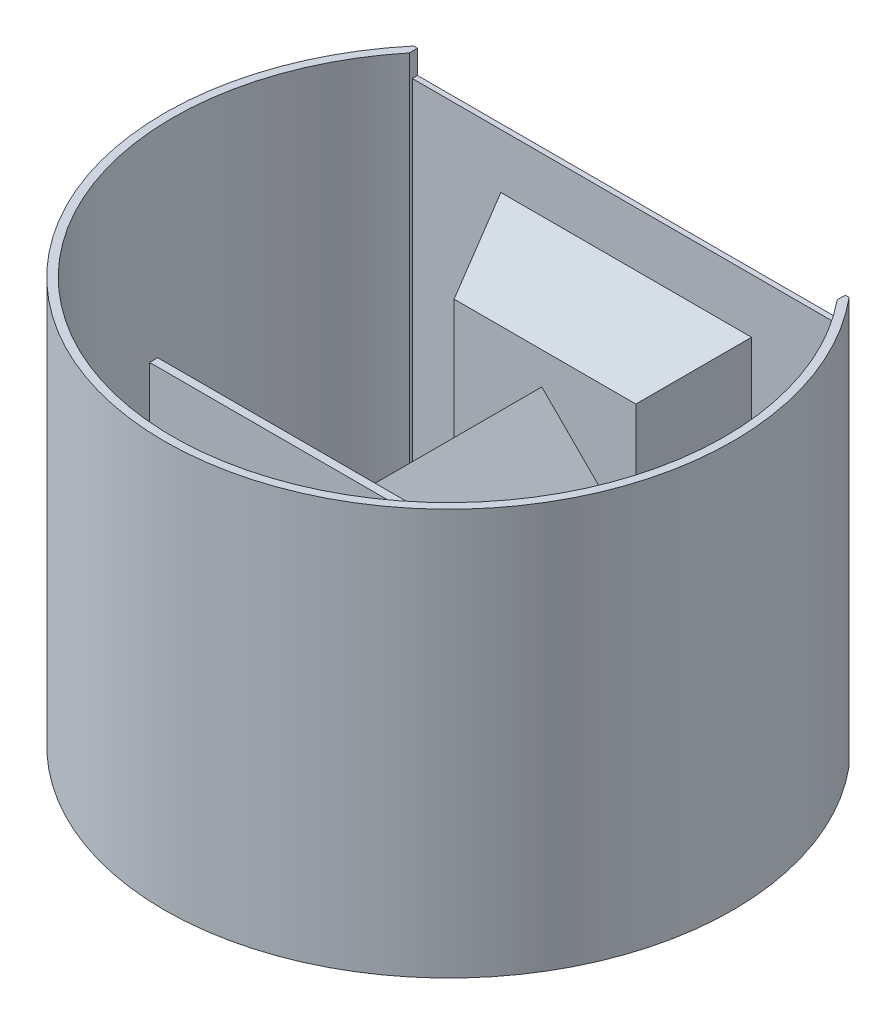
from build123d import *

# Parameters (mm, degrees)
SALIENTE_EXTRUIR1_DEPTH = 100
CROQUIS2_W              = 1.282639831
CROQUIS2_H              = 88.372891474
SALIENTE_EXTRUIR2_DEPTH = 106
CROQUIS3_W              = 61.743986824
CROQUIS3_H              = 61.53261187
SALIENTE_EXTRUIR3_DEPTH = 20
SALIENTE_EXTRUIR3_TAPER = 23
SALIENTE_EXTRUIR4_DEPTH = 61
CROQUIS5_W              = 68.764994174
CROQUIS5_H              = 68.55361922
SALIENTE_EXTRUIR5_DEPTH = 2


with BuildPart() as part:
    # Croquis1 → Saliente-Extruir1 (new body)
    with BuildSketch(Plane(origin=(0, 0, 0), x_dir=(1, 0, 0), z_dir=(0, 1, 0))):
        with BuildLine():
            Line((-53.619026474, 45), (-52.678268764, 45))
            Line((-52.678268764, 45), (-52.678268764, 43))
            ThreePointArc((-52.678268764, 43), (0, -68), (52.678268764, 43))
            Line((52.678268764, 43), (52.678268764, 45))
            Line((52.678268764, 45), (53.619026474, 45))
            ThreePointArc((53.619026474, 45), (0, -70), (-53.619026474, 45))
        make_face()
    extrude(amount=SALIENTE_EXTRUIR1_DEPTH)

    # Croquis2 → Saliente-Extruir2 (add)
    with BuildSketch(Plane(origin=(-52.678268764, 0, 0), x_dir=(0, 0, -1), z_dir=(1, 0, 0))):
        with Locations((44.358680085, 50)):
            Rectangle(CROQUIS2_W, CROQUIS2_H)
    extrude(amount=SALIENTE_EXTRUIR2_DEPTH)

    # Croquis3 → Saliente-Extruir3 (add)
    with BuildSketch(Plane.XY.offset(-43.717360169)):
        with Locations((0, 50)):
            Rectangle(CROQUIS3_W, CROQUIS3_H)
    extrude(amount=SALIENTE_EXTRUIR3_DEPTH, taper=SALIENTE_EXTRUIR3_TAPER)

    # Croquis4 → Saliente-Extruir4 (add)
    with BuildSketch(Plane.XY.offset(-23.717360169)):
        Polygon((-15.784877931, 49.335758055), (-0.784877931, 64.335758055), (14.215122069, 49.335758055), (-0.784877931, 34.335758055), align=None)
    extrude(amount=SALIENTE_EXTRUIR4_DEPTH)

    # Croquis5 → Saliente-Extruir5 (add)
    with BuildSketch(Plane.XY.offset(37.282639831)):
        with Locations((0, 50)):
            Rectangle(CROQUIS5_W, CROQUIS5_H)
    extrude(amount=SALIENTE_EXTRUIR5_DEPTH)


solid = part.part
